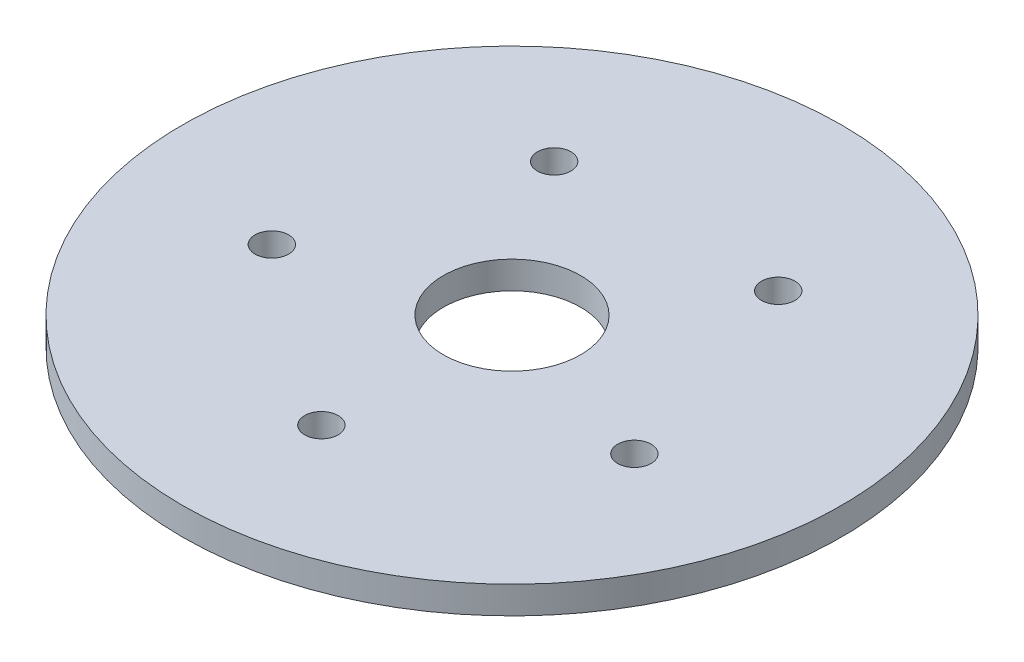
from build123d import *

# Parameters (mm, degrees)
SKETCH1_R          = 152.4
EXTRUDE1_DEPTH     = 12.7
SKETCH2_R          = 31.75
CUT_EXTRUDE1_DEPTH = 12.7
SKETCH9_R          = 7.75
CUT_EXTRUDE2_DEPTH = 216.9
CIRPATTERN1_COUNT  = 5


with BuildPart() as part:
    # Sketch1 → Extrude1 (new body)
    with BuildSketch(Plane(origin=(0, 0, 0), x_dir=(1, 0, 0), z_dir=(0, 1, 0))):
        with Locations(Location((0, 0, 0), (0, 0, 270))):
            Circle(SKETCH1_R)
    extrude(amount=EXTRUDE1_DEPTH)

    # Sketch2 → Cut-Extrude1 (cut)
    with BuildSketch(Plane(origin=(0, 12.7, 0), x_dir=(1, 0, 0), z_dir=(0, 1, 0))):
        with Locations(Location((0, 0, 0), (0, 0, 270))):
            Circle(SKETCH2_R)
    extrude(amount=-CUT_EXTRUDE1_DEPTH, mode=Mode.SUBTRACT)

    # Sketch9 → Cut-Extrude2 (cut, through all)
    with BuildSketch(Plane.XZ):
        with Locations(Location((0, 88.15011119, 0), (0, 0, 270))):
            Circle(SKETCH9_R)
    cut_extrude2 = extrude(amount=-CUT_EXTRUDE2_DEPTH, mode=Mode.SUBTRACT)

    # CirPattern1: Cut-Extrude2 ×5 about axis
    cirpattern1_axis = Axis((0, 0, 0), (0, 1, 0))
    for i in range(1, CIRPATTERN1_COUNT):
        add(cut_extrude2.rotate(cirpattern1_axis, i * 360 / CIRPATTERN1_COUNT), mode=Mode.SUBTRACT)


solid = part.part
